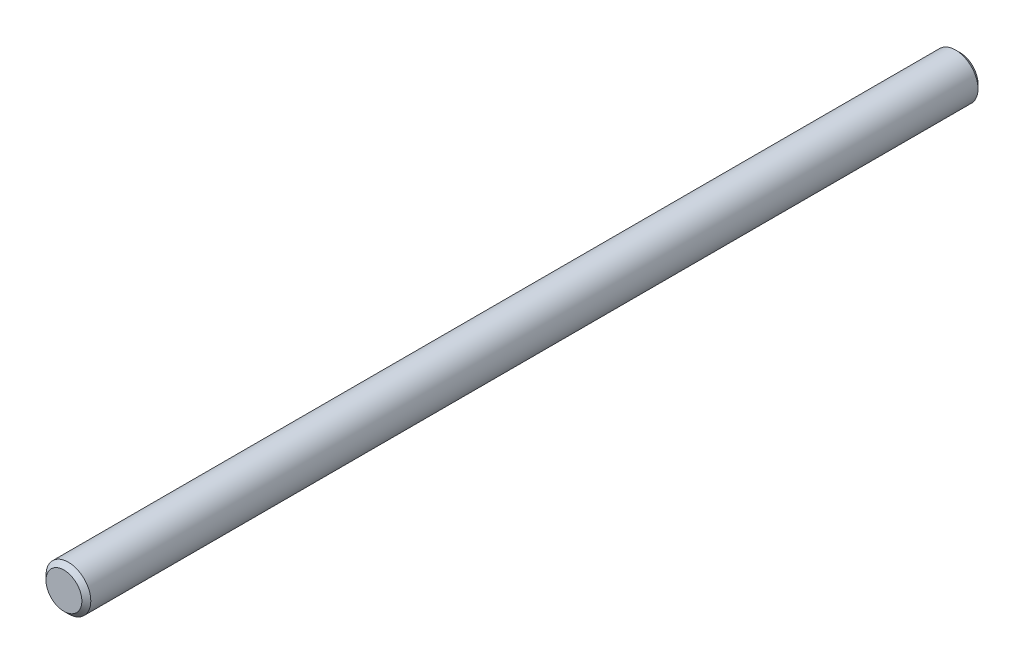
ISO-10303-21;
HEADER;
FILE_DESCRIPTION(('STEP AP214'),'2;1');
FILE_NAME('part.step','',(''),(''),'','','');
FILE_SCHEMA(('AUTOMOTIVE_DESIGN { 1 0 10303 214 1 1 1 1 }'));
ENDSEC;
DATA;
#1=APPLICATION_CONTEXT('core data for automotive mechanical design processes');
#2=APPLICATION_PROTOCOL_DEFINITION('international standard','automotive_design',2000,#1);
#3=PRODUCT_CONTEXT('',#1,'mechanical');
#4=PRODUCT('Part','Part','',(#3));
#5=PRODUCT_RELATED_PRODUCT_CATEGORY('part','',(#4));
#6=PRODUCT_DEFINITION_FORMATION('','',#4);
#7=PRODUCT_DEFINITION_CONTEXT('part definition',#1,'design');
#8=PRODUCT_DEFINITION('design','',#6,#7);
#9=PRODUCT_DEFINITION_SHAPE('','',#8);
#10=(LENGTH_UNIT() NAMED_UNIT(*) SI_UNIT(.MILLI.,.METRE.));
#11=(NAMED_UNIT(*) PLANE_ANGLE_UNIT() SI_UNIT($,.RADIAN.));
#12=(NAMED_UNIT(*) SI_UNIT($,.STERADIAN.) SOLID_ANGLE_UNIT());
#13=UNCERTAINTY_MEASURE_WITH_UNIT(LENGTH_MEASURE(1.E-05),#10,'distance_accuracy_value','');
#14=(GEOMETRIC_REPRESENTATION_CONTEXT(3) GLOBAL_UNCERTAINTY_ASSIGNED_CONTEXT((#13)) GLOBAL_UNIT_ASSIGNED_CONTEXT((#10,
#11,#12)) REPRESENTATION_CONTEXT('',''));
#15=CARTESIAN_POINT('',(0.,0.,0.));
#16=DIRECTION('',(0.,0.,1.));
#17=DIRECTION('',(1.,0.,0.));
#18=AXIS2_PLACEMENT_3D('',#15,#16,#17);
#19=CARTESIAN_POINT('',(0.,0.,40.));
#20=DIRECTION('',(0.,0.,-1.));
#21=DIRECTION('',(-1.,0.,0.));
#22=AXIS2_PLACEMENT_3D('',#19,#20,#21);
#23=CYLINDRICAL_SURFACE('',#22,1.);
#24=CARTESIAN_POINT('',(0.,0.,39.8));
#25=DIRECTION('',(0.,0.,1.));
#26=DIRECTION('',(1.,0.,0.));
#27=AXIS2_PLACEMENT_3D('',#24,#25,#26);
#28=CIRCLE('',#27,1.);
#29=CARTESIAN_POINT('',(1.,0.,39.8));
#30=VERTEX_POINT('',#29);
#31=EDGE_CURVE('E359',#30,#30,#28,.F.);
#32=ORIENTED_EDGE('',*,*,#31,.T.);
#33=EDGE_LOOP('',(#32));
#34=FACE_BOUND('',#33,.T.);
#35=CARTESIAN_POINT('',(0.,0.,0.199999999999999));
#36=DIRECTION('',(0.,0.,1.));
#37=DIRECTION('',(1.,0.,0.));
#38=AXIS2_PLACEMENT_3D('',#35,#36,#37);
#39=CIRCLE('',#38,1.);
#40=CARTESIAN_POINT('',(1.,0.,0.199999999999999));
#41=VERTEX_POINT('',#40);
#42=EDGE_CURVE('E363',#41,#41,#39,.T.);
#43=ORIENTED_EDGE('',*,*,#42,.T.);
#44=EDGE_LOOP('',(#43));
#45=FACE_BOUND('',#44,.T.);
#46=ADVANCED_FACE('F353',(#34,#45),#23,.T.);
#47=CARTESIAN_POINT('',(0.,0.,40.));
#48=DIRECTION('',(0.,0.,1.));
#49=DIRECTION('',(1.,0.,0.));
#50=AXIS2_PLACEMENT_3D('',#47,#48,#49);
#51=PLANE('',#50);
#52=CARTESIAN_POINT('',(0.,0.,40.));
#53=DIRECTION('',(0.,0.,1.));
#54=DIRECTION('',(1.,0.,0.));
#55=AXIS2_PLACEMENT_3D('',#52,#53,#54);
#56=CIRCLE('',#55,0.800000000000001);
#57=CARTESIAN_POINT('',(0.800000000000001,0.,40.));
#58=VERTEX_POINT('',#57);
#59=EDGE_CURVE('E367',#58,#58,#56,.T.);
#60=ORIENTED_EDGE('',*,*,#59,.T.);
#61=EDGE_LOOP('',(#60));
#62=FACE_BOUND('',#61,.T.);
#63=ADVANCED_FACE('F373',(#62),#51,.T.);
#64=CARTESIAN_POINT('',(0.,0.,0.));
#65=DIRECTION('',(0.,0.,1.));
#66=DIRECTION('',(1.,0.,0.));
#67=AXIS2_PLACEMENT_3D('',#64,#65,#66);
#68=PLANE('',#67);
#69=CARTESIAN_POINT('',(0.,0.,0.));
#70=DIRECTION('',(0.,0.,1.));
#71=DIRECTION('',(1.,0.,0.));
#72=AXIS2_PLACEMENT_3D('',#69,#70,#71);
#73=CIRCLE('',#72,0.799999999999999);
#74=CARTESIAN_POINT('',(0.799999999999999,0.,0.));
#75=VERTEX_POINT('',#74);
#76=EDGE_CURVE('E10',#75,#75,#73,.F.);
#77=ORIENTED_EDGE('',*,*,#76,.T.);
#78=EDGE_LOOP('',(#77));
#79=FACE_BOUND('',#78,.T.);
#80=ADVANCED_FACE('F378',(#79),#68,.F.);
#81=CARTESIAN_POINT('',(0.,0.,40.));
#82=DIRECTION('',(0.,0.,-1.));
#83=DIRECTION('',(-1.,0.,0.));
#84=AXIS2_PLACEMENT_3D('',#81,#82,#83);
#85=CONICAL_SURFACE('',#84,0.800000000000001,0.785398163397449);
#86=ORIENTED_EDGE('',*,*,#31,.F.);
#87=EDGE_LOOP('',(#86));
#88=FACE_BOUND('',#87,.T.);
#89=ORIENTED_EDGE('',*,*,#59,.F.);
#90=EDGE_LOOP('',(#89));
#91=FACE_BOUND('',#90,.T.);
#92=ADVANCED_FACE('F375',(#88,#91),#85,.T.);
#93=CARTESIAN_POINT('',(0.,0.,0.199999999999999));
#94=DIRECTION('',(0.,0.,1.));
#95=DIRECTION('',(1.,0.,0.));
#96=AXIS2_PLACEMENT_3D('',#93,#94,#95);
#97=CONICAL_SURFACE('',#96,1.,0.785398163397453);
#98=ORIENTED_EDGE('',*,*,#76,.F.);
#99=EDGE_LOOP('',(#98));
#100=FACE_BOUND('',#99,.T.);
#101=ORIENTED_EDGE('',*,*,#42,.F.);
#102=EDGE_LOOP('',(#101));
#103=FACE_BOUND('',#102,.T.);
#104=ADVANCED_FACE('F377',(#100,#103),#97,.T.);
#105=CLOSED_SHELL('',(#46,#63,#80,#92,#104));
#106=MANIFOLD_SOLID_BREP('B2',#105);
#107=ADVANCED_BREP_SHAPE_REPRESENTATION('',(#18,#106),#14);
#108=SHAPE_DEFINITION_REPRESENTATION(#9,#107);
ENDSEC;
END-ISO-10303-21;
